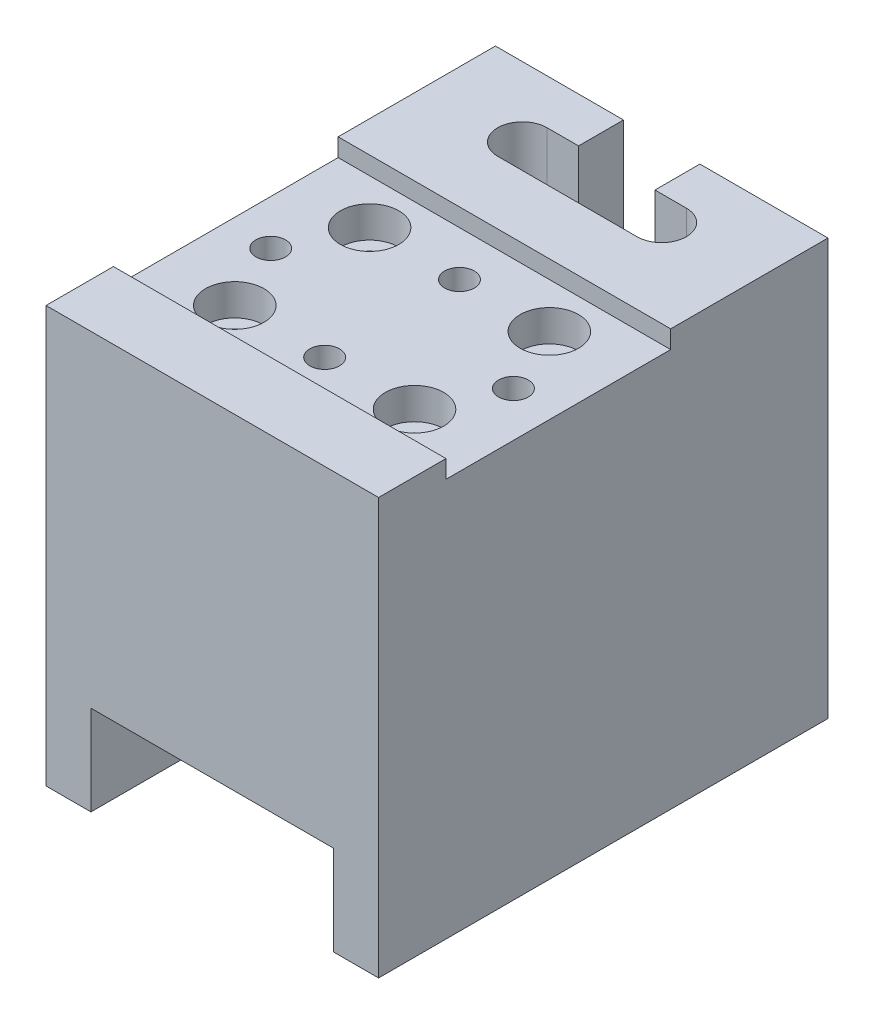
ISO-10303-21;
HEADER;
FILE_DESCRIPTION(('STEP AP214'),'2;1');
FILE_NAME('part.step','',(''),(''),'','','');
FILE_SCHEMA(('AUTOMOTIVE_DESIGN { 1 0 10303 214 1 1 1 1 }'));
ENDSEC;
DATA;
#1=APPLICATION_CONTEXT('core data for automotive mechanical design processes');
#2=APPLICATION_PROTOCOL_DEFINITION('international standard','automotive_design',2000,#1);
#3=PRODUCT_CONTEXT('',#1,'mechanical');
#4=PRODUCT('Part','Part','',(#3));
#5=PRODUCT_RELATED_PRODUCT_CATEGORY('part','',(#4));
#6=PRODUCT_DEFINITION_FORMATION('','',#4);
#7=PRODUCT_DEFINITION_CONTEXT('part definition',#1,'design');
#8=PRODUCT_DEFINITION('design','',#6,#7);
#9=PRODUCT_DEFINITION_SHAPE('','',#8);
#10=(LENGTH_UNIT() NAMED_UNIT(*) SI_UNIT(.MILLI.,.METRE.));
#11=(NAMED_UNIT(*) PLANE_ANGLE_UNIT() SI_UNIT($,.RADIAN.));
#12=(NAMED_UNIT(*) SI_UNIT($,.STERADIAN.) SOLID_ANGLE_UNIT());
#13=UNCERTAINTY_MEASURE_WITH_UNIT(LENGTH_MEASURE(1.E-05),#10,'distance_accuracy_value','');
#14=(GEOMETRIC_REPRESENTATION_CONTEXT(3) GLOBAL_UNCERTAINTY_ASSIGNED_CONTEXT((#13)) GLOBAL_UNIT_ASSIGNED_CONTEXT((#10,
#11,#12)) REPRESENTATION_CONTEXT('',''));
#15=CARTESIAN_POINT('',(0.,0.,0.));
#16=DIRECTION('',(0.,0.,1.));
#17=DIRECTION('',(1.,0.,0.));
#18=AXIS2_PLACEMENT_3D('',#15,#16,#17);
#19=CARTESIAN_POINT('',(8.49999999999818,-3.69999999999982,22.5));
#20=DIRECTION('',(0.,1.,0.));
#21=DIRECTION('',(0.,0.,1.));
#22=AXIS2_PLACEMENT_3D('',#19,#20,#21);
#23=CYLINDRICAL_SURFACE('',#22,1.75);
#24=CARTESIAN_POINT('',(8.49999999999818,10.,22.5));
#25=DIRECTION('',(0.,1.,0.));
#26=DIRECTION('',(0.,0.,1.));
#27=AXIS2_PLACEMENT_3D('',#24,#25,#26);
#28=CIRCLE('',#27,1.75);
#29=CARTESIAN_POINT('',(8.49999999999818,10.,24.25));
#30=VERTEX_POINT('',#29);
#31=EDGE_CURVE('E236',#30,#30,#28,.T.);
#32=ORIENTED_EDGE('',*,*,#31,.F.);
#33=EDGE_LOOP('',(#32));
#34=FACE_BOUND('',#33,.T.);
#35=CARTESIAN_POINT('',(8.49999999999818,40.8000000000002,22.5));
#36=DIRECTION('',(0.,1.,0.));
#37=DIRECTION('',(0.,0.,1.));
#38=AXIS2_PLACEMENT_3D('',#35,#36,#37);
#39=CIRCLE('',#38,1.75);
#40=CARTESIAN_POINT('',(8.49999999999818,40.8000000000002,24.25));
#41=VERTEX_POINT('',#40);
#42=EDGE_CURVE('E37',#41,#41,#39,.F.);
#43=ORIENTED_EDGE('',*,*,#42,.F.);
#44=EDGE_LOOP('',(#43));
#45=FACE_BOUND('',#44,.T.);
#46=ADVANCED_FACE('F33',(#34,#45),#23,.F.);
#47=CARTESIAN_POINT('',(28.4999999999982,-3.69999999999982,22.5));
#48=DIRECTION('',(0.,1.,0.));
#49=DIRECTION('',(0.,0.,1.));
#50=AXIS2_PLACEMENT_3D('',#47,#48,#49);
#51=CYLINDRICAL_SURFACE('',#50,1.75);
#52=CARTESIAN_POINT('',(28.4999999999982,10.,22.5));
#53=DIRECTION('',(0.,1.,0.));
#54=DIRECTION('',(0.,0.,1.));
#55=AXIS2_PLACEMENT_3D('',#52,#53,#54);
#56=CIRCLE('',#55,1.75);
#57=CARTESIAN_POINT('',(28.4999999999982,10.,24.25));
#58=VERTEX_POINT('',#57);
#59=EDGE_CURVE('E239',#58,#58,#56,.T.);
#60=ORIENTED_EDGE('',*,*,#59,.F.);
#61=EDGE_LOOP('',(#60));
#62=FACE_BOUND('',#61,.T.);
#63=CARTESIAN_POINT('',(28.4999999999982,40.8000000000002,22.5));
#64=DIRECTION('',(0.,1.,0.));
#65=DIRECTION('',(0.,0.,1.));
#66=AXIS2_PLACEMENT_3D('',#63,#64,#65);
#67=CIRCLE('',#66,1.75);
#68=CARTESIAN_POINT('',(28.4999999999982,40.8000000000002,24.25));
#69=VERTEX_POINT('',#68);
#70=EDGE_CURVE('E342',#69,#69,#67,.F.);
#71=ORIENTED_EDGE('',*,*,#70,.F.);
#72=EDGE_LOOP('',(#71));
#73=FACE_BOUND('',#72,.T.);
#74=ADVANCED_FACE('F458',(#62,#73),#51,.F.);
#75=CARTESIAN_POINT('',(28.4999999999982,-3.69999999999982,37.5));
#76=DIRECTION('',(0.,1.,0.));
#77=DIRECTION('',(0.,0.,1.));
#78=AXIS2_PLACEMENT_3D('',#75,#76,#77);
#79=CYLINDRICAL_SURFACE('',#78,1.75);
#80=CARTESIAN_POINT('',(28.4999999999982,10.,37.5));
#81=DIRECTION('',(0.,1.,0.));
#82=DIRECTION('',(0.,0.,1.));
#83=AXIS2_PLACEMENT_3D('',#80,#81,#82);
#84=CIRCLE('',#83,1.75);
#85=CARTESIAN_POINT('',(28.4999999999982,10.,39.25));
#86=VERTEX_POINT('',#85);
#87=EDGE_CURVE('E242',#86,#86,#84,.T.);
#88=ORIENTED_EDGE('',*,*,#87,.F.);
#89=EDGE_LOOP('',(#88));
#90=FACE_BOUND('',#89,.T.);
#91=CARTESIAN_POINT('',(28.4999999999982,40.8000000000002,37.5));
#92=DIRECTION('',(0.,1.,0.));
#93=DIRECTION('',(0.,0.,1.));
#94=AXIS2_PLACEMENT_3D('',#91,#92,#93);
#95=CIRCLE('',#94,1.75);
#96=CARTESIAN_POINT('',(28.4999999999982,40.8000000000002,39.25));
#97=VERTEX_POINT('',#96);
#98=EDGE_CURVE('E339',#97,#97,#95,.F.);
#99=ORIENTED_EDGE('',*,*,#98,.F.);
#100=EDGE_LOOP('',(#99));
#101=FACE_BOUND('',#100,.T.);
#102=ADVANCED_FACE('F464',(#90,#101),#79,.F.);
#103=CARTESIAN_POINT('',(8.49999999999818,-3.69999999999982,37.5));
#104=DIRECTION('',(0.,1.,0.));
#105=DIRECTION('',(0.,0.,1.));
#106=AXIS2_PLACEMENT_3D('',#103,#104,#105);
#107=CYLINDRICAL_SURFACE('',#106,1.75);
#108=CARTESIAN_POINT('',(8.49999999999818,10.,37.5));
#109=DIRECTION('',(0.,1.,0.));
#110=DIRECTION('',(0.,0.,1.));
#111=AXIS2_PLACEMENT_3D('',#108,#109,#110);
#112=CIRCLE('',#111,1.75);
#113=CARTESIAN_POINT('',(8.49999999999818,10.,39.25));
#114=VERTEX_POINT('',#113);
#115=EDGE_CURVE('E245',#114,#114,#112,.T.);
#116=ORIENTED_EDGE('',*,*,#115,.F.);
#117=EDGE_LOOP('',(#116));
#118=FACE_BOUND('',#117,.T.);
#119=CARTESIAN_POINT('',(8.49999999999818,40.8000000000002,37.5));
#120=DIRECTION('',(0.,1.,0.));
#121=DIRECTION('',(0.,0.,1.));
#122=AXIS2_PLACEMENT_3D('',#119,#120,#121);
#123=CIRCLE('',#122,1.75);
#124=CARTESIAN_POINT('',(8.49999999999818,40.8000000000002,39.25));
#125=VERTEX_POINT('',#124);
#126=EDGE_CURVE('E194',#125,#125,#123,.F.);
#127=ORIENTED_EDGE('',*,*,#126,.F.);
#128=EDGE_LOOP('',(#127));
#129=FACE_BOUND('',#128,.T.);
#130=ADVANCED_FACE('F474',(#118,#129),#107,.F.);
#131=CARTESIAN_POINT('',(5.00000000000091,10.,50.));
#132=DIRECTION('',(0.,1.,0.));
#133=DIRECTION('',(0.,0.,1.));
#134=AXIS2_PLACEMENT_3D('',#131,#132,#133);
#135=PLANE('',#134);
#136=ORIENTED_EDGE('',*,*,#115,.T.);
#137=EDGE_LOOP('',(#136));
#138=FACE_BOUND('',#137,.T.);
#139=ORIENTED_EDGE('',*,*,#87,.T.);
#140=EDGE_LOOP('',(#139));
#141=FACE_BOUND('',#140,.T.);
#142=ORIENTED_EDGE('',*,*,#59,.T.);
#143=EDGE_LOOP('',(#142));
#144=FACE_BOUND('',#143,.T.);
#145=ORIENTED_EDGE('',*,*,#31,.T.);
#146=EDGE_LOOP('',(#145));
#147=FACE_BOUND('',#146,.T.);
#148=DIRECTION('',(0.,0.,-1.));
#149=VECTOR('',#148,1.);
#150=CARTESIAN_POINT('',(14.25,10.,50.));
#151=LINE('',#150,#149);
#152=CARTESIAN_POINT('',(14.25,10.,5.));
#153=VERTEX_POINT('',#152);
#154=CARTESIAN_POINT('',(14.25,10.,0.));
#155=VERTEX_POINT('',#154);
#156=EDGE_CURVE('E224',#153,#155,#151,.T.);
#157=ORIENTED_EDGE('',*,*,#156,.F.);
#158=DIRECTION('',(1.,0.,0.));
#159=VECTOR('',#158,1.);
#160=CARTESIAN_POINT('',(5.00000000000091,10.,5.));
#161=LINE('',#160,#159);
#162=CARTESIAN_POINT('',(10.75,10.,5.));
#163=VERTEX_POINT('',#162);
#164=EDGE_CURVE('E234',#163,#153,#161,.T.);
#165=ORIENTED_EDGE('',*,*,#164,.F.);
#166=CARTESIAN_POINT('',(10.75,10.,7.75));
#167=DIRECTION('',(0.,1.,0.));
#168=DIRECTION('',(0.,0.,1.));
#169=AXIS2_PLACEMENT_3D('',#166,#167,#168);
#170=CIRCLE('',#169,2.75);
#171=CARTESIAN_POINT('',(10.75,10.,10.5));
#172=VERTEX_POINT('',#171);
#173=EDGE_CURVE('E232',#172,#163,#170,.F.);
#174=ORIENTED_EDGE('',*,*,#173,.F.);
#175=DIRECTION('',(-1.,0.,0.));
#176=VECTOR('',#175,1.);
#177=CARTESIAN_POINT('',(5.00000000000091,10.,10.5));
#178=LINE('',#177,#176);
#179=CARTESIAN_POINT('',(26.25,10.,10.5));
#180=VERTEX_POINT('',#179);
#181=EDGE_CURVE('E230',#180,#172,#178,.T.);
#182=ORIENTED_EDGE('',*,*,#181,.F.);
#183=CARTESIAN_POINT('',(26.25,10.,7.75));
#184=DIRECTION('',(0.,1.,0.));
#185=DIRECTION('',(0.,0.,1.));
#186=AXIS2_PLACEMENT_3D('',#183,#184,#185);
#187=CIRCLE('',#186,2.75);
#188=CARTESIAN_POINT('',(26.25,10.,5.));
#189=VERTEX_POINT('',#188);
#190=EDGE_CURVE('E228',#189,#180,#187,.F.);
#191=ORIENTED_EDGE('',*,*,#190,.F.);
#192=DIRECTION('',(1.,0.,0.));
#193=VECTOR('',#192,1.);
#194=CARTESIAN_POINT('',(5.00000000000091,10.,5.));
#195=LINE('',#194,#193);
#196=CARTESIAN_POINT('',(22.75,10.,5.));
#197=VERTEX_POINT('',#196);
#198=EDGE_CURVE('E226',#197,#189,#195,.T.);
#199=ORIENTED_EDGE('',*,*,#198,.F.);
#200=DIRECTION('',(0.,0.,1.));
#201=VECTOR('',#200,1.);
#202=CARTESIAN_POINT('',(22.75,10.,50.));
#203=LINE('',#202,#201);
#204=CARTESIAN_POINT('',(22.75,10.,0.));
#205=VERTEX_POINT('',#204);
#206=EDGE_CURVE('E174',#205,#197,#203,.T.);
#207=ORIENTED_EDGE('',*,*,#206,.F.);
#208=DIRECTION('',(1.,0.,0.));
#209=VECTOR('',#208,1.);
#210=CARTESIAN_POINT('',(5.00000000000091,10.,0.));
#211=LINE('',#210,#209);
#212=CARTESIAN_POINT('',(32.,10.,0.));
#213=VERTEX_POINT('',#212);
#214=EDGE_CURVE('E289',#205,#213,#211,.T.);
#215=ORIENTED_EDGE('',*,*,#214,.T.);
#216=DIRECTION('',(0.,0.,-1.));
#217=VECTOR('',#216,1.);
#218=CARTESIAN_POINT('',(32.,10.,50.));
#219=LINE('',#218,#217);
#220=CARTESIAN_POINT('',(32.,10.,50.));
#221=VERTEX_POINT('',#220);
#222=EDGE_CURVE('E324',#221,#213,#219,.T.);
#223=ORIENTED_EDGE('',*,*,#222,.F.);
#224=DIRECTION('',(1.,0.,0.));
#225=VECTOR('',#224,1.);
#226=CARTESIAN_POINT('',(5.00000000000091,10.,50.));
#227=LINE('',#226,#225);
#228=CARTESIAN_POINT('',(5.00000000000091,10.,50.));
#229=VERTEX_POINT('',#228);
#230=EDGE_CURVE('E271',#229,#221,#227,.T.);
#231=ORIENTED_EDGE('',*,*,#230,.F.);
#232=DIRECTION('',(0.,0.,-1.));
#233=VECTOR('',#232,1.);
#234=CARTESIAN_POINT('',(5.00000000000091,10.,50.));
#235=LINE('',#234,#233);
#236=CARTESIAN_POINT('',(5.00000000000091,10.,0.));
#237=VERTEX_POINT('',#236);
#238=EDGE_CURVE('E327',#229,#237,#235,.T.);
#239=ORIENTED_EDGE('',*,*,#238,.T.);
#240=EDGE_CURVE('E290',#237,#155,#211,.T.);
#241=ORIENTED_EDGE('',*,*,#240,.T.);
#242=EDGE_LOOP('',(#157,#165,#174,#182,#191,#199,#207,#215,#223,#231,#239,#241));
#243=FACE_BOUND('',#242,.T.);
#244=ADVANCED_FACE('F425',(#138,#141,#144,#147,#243),#135,.F.);
#245=CARTESIAN_POINT('',(0.,46.3000000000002,50.));
#246=DIRECTION('',(0.,-1.,0.));
#247=DIRECTION('',(0.,0.,-1.));
#248=AXIS2_PLACEMENT_3D('',#245,#246,#247);
#249=PLANE('',#248);
#250=DIRECTION('',(0.,0.,-1.));
#251=VECTOR('',#250,1.);
#252=CARTESIAN_POINT('',(14.25,46.3000000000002,5.));
#253=LINE('',#252,#251);
#254=CARTESIAN_POINT('',(14.25,46.3000000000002,5.));
#255=VERTEX_POINT('',#254);
#256=CARTESIAN_POINT('',(14.25,46.3000000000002,0.));
#257=VERTEX_POINT('',#256);
#258=EDGE_CURVE('E178',#255,#257,#253,.T.);
#259=ORIENTED_EDGE('',*,*,#258,.T.);
#260=DIRECTION('',(-1.,0.,0.));
#261=VECTOR('',#260,1.);
#262=CARTESIAN_POINT('',(0.,46.3000000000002,0.));
#263=LINE('',#262,#261);
#264=CARTESIAN_POINT('',(0.,46.3000000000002,0.));
#265=VERTEX_POINT('',#264);
#266=EDGE_CURVE('E300',#257,#265,#263,.T.);
#267=ORIENTED_EDGE('',*,*,#266,.T.);
#268=DIRECTION('',(0.,0.,-1.));
#269=VECTOR('',#268,1.);
#270=CARTESIAN_POINT('',(0.,46.3000000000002,50.));
#271=LINE('',#270,#269);
#272=CARTESIAN_POINT('',(0.,46.3000000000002,17.5));
#273=VERTEX_POINT('',#272);
#274=EDGE_CURVE('E310',#273,#265,#271,.T.);
#275=ORIENTED_EDGE('',*,*,#274,.F.);
#276=DIRECTION('',(-1.,0.,0.));
#277=VECTOR('',#276,1.);
#278=CARTESIAN_POINT('',(173.926921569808,46.3000000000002,17.5));
#279=LINE('',#278,#277);
#280=CARTESIAN_POINT('',(37.,46.3000000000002,17.5));
#281=VERTEX_POINT('',#280);
#282=EDGE_CURVE('E58',#281,#273,#279,.T.);
#283=ORIENTED_EDGE('',*,*,#282,.F.);
#284=DIRECTION('',(0.,0.,-1.));
#285=VECTOR('',#284,1.);
#286=CARTESIAN_POINT('',(37.,46.3000000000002,50.));
#287=LINE('',#286,#285);
#288=CARTESIAN_POINT('',(37.,46.3000000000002,0.));
#289=VERTEX_POINT('',#288);
#290=EDGE_CURVE('E314',#281,#289,#287,.T.);
#291=ORIENTED_EDGE('',*,*,#290,.T.);
#292=CARTESIAN_POINT('',(22.75,46.3000000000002,0.));
#293=VERTEX_POINT('',#292);
#294=EDGE_CURVE('E193',#289,#293,#263,.T.);
#295=ORIENTED_EDGE('',*,*,#294,.T.);
#296=DIRECTION('',(0.,0.,1.));
#297=VECTOR('',#296,1.);
#298=CARTESIAN_POINT('',(22.75,46.3000000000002,5.));
#299=LINE('',#298,#297);
#300=CARTESIAN_POINT('',(22.75,46.3000000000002,5.));
#301=VERTEX_POINT('',#300);
#302=EDGE_CURVE('E50',#293,#301,#299,.T.);
#303=ORIENTED_EDGE('',*,*,#302,.T.);
#304=DIRECTION('',(1.,0.,0.));
#305=VECTOR('',#304,1.);
#306=CARTESIAN_POINT('',(22.75,46.3000000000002,5.));
#307=LINE('',#306,#305);
#308=CARTESIAN_POINT('',(26.25,46.3000000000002,5.));
#309=VERTEX_POINT('',#308);
#310=EDGE_CURVE('E181',#301,#309,#307,.T.);
#311=ORIENTED_EDGE('',*,*,#310,.T.);
#312=CARTESIAN_POINT('',(26.25,46.3000000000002,7.75));
#313=DIRECTION('',(0.,-1.,0.));
#314=DIRECTION('',(0.,0.,1.));
#315=AXIS2_PLACEMENT_3D('',#312,#313,#314);
#316=CIRCLE('',#315,2.75);
#317=CARTESIAN_POINT('',(26.25,46.3000000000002,10.5));
#318=VERTEX_POINT('',#317);
#319=EDGE_CURVE('E187',#309,#318,#316,.T.);
#320=ORIENTED_EDGE('',*,*,#319,.T.);
#321=DIRECTION('',(-1.,0.,0.));
#322=VECTOR('',#321,1.);
#323=CARTESIAN_POINT('',(10.75,46.3000000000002,10.5));
#324=LINE('',#323,#322);
#325=CARTESIAN_POINT('',(10.75,46.3000000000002,10.5));
#326=VERTEX_POINT('',#325);
#327=EDGE_CURVE('E204',#318,#326,#324,.T.);
#328=ORIENTED_EDGE('',*,*,#327,.T.);
#329=CARTESIAN_POINT('',(10.75,46.3000000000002,7.75));
#330=DIRECTION('',(0.,-1.,0.));
#331=DIRECTION('',(0.,0.,1.));
#332=AXIS2_PLACEMENT_3D('',#329,#330,#331);
#333=CIRCLE('',#332,2.75);
#334=CARTESIAN_POINT('',(10.75,46.3000000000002,5.));
#335=VERTEX_POINT('',#334);
#336=EDGE_CURVE('E207',#326,#335,#333,.T.);
#337=ORIENTED_EDGE('',*,*,#336,.T.);
#338=DIRECTION('',(1.,0.,0.));
#339=VECTOR('',#338,1.);
#340=CARTESIAN_POINT('',(10.75,46.3000000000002,5.));
#341=LINE('',#340,#339);
#342=EDGE_CURVE('E210',#335,#255,#341,.T.);
#343=ORIENTED_EDGE('',*,*,#342,.T.);
#344=EDGE_LOOP('',(#259,#267,#275,#283,#291,#295,#303,#311,#320,#328,#337,#343));
#345=FACE_BOUND('',#344,.T.);
#346=ADVANCED_FACE('F191',(#345),#249,.F.);
#347=CARTESIAN_POINT('',(5.00000000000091,10.,0.));
#348=DIRECTION('',(0.,0.,-1.));
#349=DIRECTION('',(-1.,0.,0.));
#350=AXIS2_PLACEMENT_3D('',#347,#348,#349);
#351=PLANE('',#350);
#352=ORIENTED_EDGE('',*,*,#266,.F.);
#353=DIRECTION('',(0.,-1.,0.));
#354=VECTOR('',#353,1.);
#355=CARTESIAN_POINT('',(14.25,10.,0.));
#356=LINE('',#355,#354);
#357=EDGE_CURVE('E12',#257,#155,#356,.T.);
#358=ORIENTED_EDGE('',*,*,#357,.T.);
#359=ORIENTED_EDGE('',*,*,#240,.F.);
#360=DIRECTION('',(0.,1.,0.));
#361=VECTOR('',#360,1.);
#362=CARTESIAN_POINT('',(5.,0.,0.));
#363=LINE('',#362,#361);
#364=CARTESIAN_POINT('',(5.,0.,0.));
#365=VERTEX_POINT('',#364);
#366=EDGE_CURVE('E267',#365,#237,#363,.T.);
#367=ORIENTED_EDGE('',*,*,#366,.F.);
#368=DIRECTION('',(1.,0.,0.));
#369=VECTOR('',#368,1.);
#370=CARTESIAN_POINT('',(0.,0.,0.));
#371=LINE('',#370,#369);
#372=CARTESIAN_POINT('',(0.,0.,0.));
#373=VERTEX_POINT('',#372);
#374=EDGE_CURVE('E272',#373,#365,#371,.T.);
#375=ORIENTED_EDGE('',*,*,#374,.F.);
#376=DIRECTION('',(0.,-1.,0.));
#377=VECTOR('',#376,1.);
#378=CARTESIAN_POINT('',(0.,0.,0.));
#379=LINE('',#378,#377);
#380=EDGE_CURVE('E302',#265,#373,#379,.T.);
#381=ORIENTED_EDGE('',*,*,#380,.F.);
#382=EDGE_LOOP('',(#352,#358,#359,#367,#375,#381));
#383=FACE_BOUND('',#382,.T.);
#384=ADVANCED_FACE('F392',(#383),#351,.T.);
#385=ORIENTED_EDGE('',*,*,#214,.F.);
#386=DIRECTION('',(0.,1.,0.));
#387=VECTOR('',#386,1.);
#388=CARTESIAN_POINT('',(22.75,10.,0.));
#389=LINE('',#388,#387);
#390=EDGE_CURVE('E42',#205,#293,#389,.T.);
#391=ORIENTED_EDGE('',*,*,#390,.T.);
#392=ORIENTED_EDGE('',*,*,#294,.F.);
#393=DIRECTION('',(0.,1.,0.));
#394=VECTOR('',#393,1.);
#395=CARTESIAN_POINT('',(37.,0.,0.));
#396=LINE('',#395,#394);
#397=CARTESIAN_POINT('',(37.,0.,0.));
#398=VERTEX_POINT('',#397);
#399=EDGE_CURVE('E297',#398,#289,#396,.T.);
#400=ORIENTED_EDGE('',*,*,#399,.F.);
#401=DIRECTION('',(1.,0.,0.));
#402=VECTOR('',#401,1.);
#403=CARTESIAN_POINT('',(32.,0.,0.));
#404=LINE('',#403,#402);
#405=CARTESIAN_POINT('',(32.,0.,0.));
#406=VERTEX_POINT('',#405);
#407=EDGE_CURVE('E295',#406,#398,#404,.T.);
#408=ORIENTED_EDGE('',*,*,#407,.F.);
#409=DIRECTION('',(0.,-1.,0.));
#410=VECTOR('',#409,1.);
#411=CARTESIAN_POINT('',(32.,0.,0.));
#412=LINE('',#411,#410);
#413=EDGE_CURVE('E293',#213,#406,#412,.T.);
#414=ORIENTED_EDGE('',*,*,#413,.F.);
#415=EDGE_LOOP('',(#385,#391,#392,#400,#408,#414));
#416=FACE_BOUND('',#415,.T.);
#417=ADVANCED_FACE('F422',(#416),#351,.T.);
#418=CARTESIAN_POINT('',(37.,46.3000000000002,50.));
#419=VERTEX_POINT('',#418);
#420=CARTESIAN_POINT('',(37.,46.3000000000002,42.5));
#421=VERTEX_POINT('',#420);
#422=EDGE_CURVE('E315',#419,#421,#287,.T.);
#423=ORIENTED_EDGE('',*,*,#422,.T.);
#424=DIRECTION('',(-1.,0.,0.));
#425=VECTOR('',#424,1.);
#426=CARTESIAN_POINT('',(173.926921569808,46.3000000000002,42.5));
#427=LINE('',#426,#425);
#428=CARTESIAN_POINT('',(0.,46.3000000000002,42.5));
#429=VERTEX_POINT('',#428);
#430=EDGE_CURVE('E255',#421,#429,#427,.T.);
#431=ORIENTED_EDGE('',*,*,#430,.T.);
#432=CARTESIAN_POINT('',(0.,46.3000000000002,50.));
#433=VERTEX_POINT('',#432);
#434=EDGE_CURVE('E311',#433,#429,#271,.T.);
#435=ORIENTED_EDGE('',*,*,#434,.F.);
#436=DIRECTION('',(-1.,0.,0.));
#437=VECTOR('',#436,1.);
#438=CARTESIAN_POINT('',(0.,46.3000000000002,50.));
#439=LINE('',#438,#437);
#440=EDGE_CURVE('E280',#419,#433,#439,.T.);
#441=ORIENTED_EDGE('',*,*,#440,.F.);
#442=EDGE_LOOP('',(#423,#431,#435,#441));
#443=FACE_BOUND('',#442,.T.);
#444=ADVANCED_FACE('F408',(#443),#249,.F.);
#445=CARTESIAN_POINT('',(5.,0.,50.));
#446=DIRECTION('',(-1.,0.,0.));
#447=DIRECTION('',(0.,-1.,0.));
#448=AXIS2_PLACEMENT_3D('',#445,#446,#447);
#449=PLANE('',#448);
#450=ORIENTED_EDGE('',*,*,#366,.T.);
#451=ORIENTED_EDGE('',*,*,#238,.F.);
#452=DIRECTION('',(0.,1.,0.));
#453=VECTOR('',#452,1.);
#454=CARTESIAN_POINT('',(5.,0.,50.));
#455=LINE('',#454,#453);
#456=CARTESIAN_POINT('',(5.,0.,50.));
#457=VERTEX_POINT('',#456);
#458=EDGE_CURVE('E268',#457,#229,#455,.T.);
#459=ORIENTED_EDGE('',*,*,#458,.F.);
#460=DIRECTION('',(0.,0.,-1.));
#461=VECTOR('',#460,1.);
#462=CARTESIAN_POINT('',(5.,0.,50.));
#463=LINE('',#462,#461);
#464=EDGE_CURVE('E286',#457,#365,#463,.T.);
#465=ORIENTED_EDGE('',*,*,#464,.T.);
#466=EDGE_LOOP('',(#450,#451,#459,#465));
#467=FACE_BOUND('',#466,.T.);
#468=ADVANCED_FACE('F35',(#467),#449,.F.);
#469=CARTESIAN_POINT('',(32.,0.,50.));
#470=DIRECTION('',(1.,0.,0.));
#471=DIRECTION('',(0.,0.,-1.));
#472=AXIS2_PLACEMENT_3D('',#469,#470,#471);
#473=PLANE('',#472);
#474=ORIENTED_EDGE('',*,*,#413,.T.);
#475=DIRECTION('',(0.,0.,-1.));
#476=VECTOR('',#475,1.);
#477=CARTESIAN_POINT('',(32.,0.,50.));
#478=LINE('',#477,#476);
#479=CARTESIAN_POINT('',(32.,0.,50.));
#480=VERTEX_POINT('',#479);
#481=EDGE_CURVE('E321',#480,#406,#478,.T.);
#482=ORIENTED_EDGE('',*,*,#481,.F.);
#483=DIRECTION('',(0.,-1.,0.));
#484=VECTOR('',#483,1.);
#485=CARTESIAN_POINT('',(32.,0.,50.));
#486=LINE('',#485,#484);
#487=EDGE_CURVE('E274',#221,#480,#486,.T.);
#488=ORIENTED_EDGE('',*,*,#487,.F.);
#489=ORIENTED_EDGE('',*,*,#222,.T.);
#490=EDGE_LOOP('',(#474,#482,#488,#489));
#491=FACE_BOUND('',#490,.T.);
#492=ADVANCED_FACE('F449',(#491),#473,.F.);
#493=CARTESIAN_POINT('',(32.,0.,50.));
#494=DIRECTION('',(0.,1.,0.));
#495=DIRECTION('',(0.,0.,1.));
#496=AXIS2_PLACEMENT_3D('',#493,#494,#495);
#497=PLANE('',#496);
#498=ORIENTED_EDGE('',*,*,#407,.T.);
#499=DIRECTION('',(0.,0.,-1.));
#500=VECTOR('',#499,1.);
#501=CARTESIAN_POINT('',(37.,0.,50.));
#502=LINE('',#501,#500);
#503=CARTESIAN_POINT('',(37.,0.,50.));
#504=VERTEX_POINT('',#503);
#505=EDGE_CURVE('E318',#504,#398,#502,.T.);
#506=ORIENTED_EDGE('',*,*,#505,.F.);
#507=DIRECTION('',(1.,0.,0.));
#508=VECTOR('',#507,1.);
#509=CARTESIAN_POINT('',(32.,0.,50.));
#510=LINE('',#509,#508);
#511=EDGE_CURVE('E276',#480,#504,#510,.T.);
#512=ORIENTED_EDGE('',*,*,#511,.F.);
#513=ORIENTED_EDGE('',*,*,#481,.T.);
#514=EDGE_LOOP('',(#498,#506,#512,#513));
#515=FACE_BOUND('',#514,.T.);
#516=ADVANCED_FACE('F417',(#515),#497,.F.);
#517=CARTESIAN_POINT('',(37.,0.,50.));
#518=DIRECTION('',(-1.,0.,0.));
#519=DIRECTION('',(0.,0.,1.));
#520=AXIS2_PLACEMENT_3D('',#517,#518,#519);
#521=PLANE('',#520);
#522=DIRECTION('',(0.,0.,1.));
#523=VECTOR('',#522,1.);
#524=CARTESIAN_POINT('',(37.,44.3000000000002,50.));
#525=LINE('',#524,#523);
#526=CARTESIAN_POINT('',(37.,44.3000000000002,17.5));
#527=VERTEX_POINT('',#526);
#528=CARTESIAN_POINT('',(37.,44.3000000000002,42.5));
#529=VERTEX_POINT('',#528);
#530=EDGE_CURVE('E261',#527,#529,#525,.T.);
#531=ORIENTED_EDGE('',*,*,#530,.T.);
#532=DIRECTION('',(0.,1.,0.));
#533=VECTOR('',#532,1.);
#534=CARTESIAN_POINT('',(37.,0.,42.5));
#535=LINE('',#534,#533);
#536=EDGE_CURVE('E264',#529,#421,#535,.T.);
#537=ORIENTED_EDGE('',*,*,#536,.T.);
#538=ORIENTED_EDGE('',*,*,#422,.F.);
#539=DIRECTION('',(0.,1.,0.));
#540=VECTOR('',#539,1.);
#541=CARTESIAN_POINT('',(37.,0.,50.));
#542=LINE('',#541,#540);
#543=EDGE_CURVE('E278',#504,#419,#542,.T.);
#544=ORIENTED_EDGE('',*,*,#543,.F.);
#545=ORIENTED_EDGE('',*,*,#505,.T.);
#546=ORIENTED_EDGE('',*,*,#399,.T.);
#547=ORIENTED_EDGE('',*,*,#290,.F.);
#548=DIRECTION('',(0.,-1.,0.));
#549=VECTOR('',#548,1.);
#550=CARTESIAN_POINT('',(37.,0.,17.5));
#551=LINE('',#550,#549);
#552=EDGE_CURVE('E258',#281,#527,#551,.T.);
#553=ORIENTED_EDGE('',*,*,#552,.T.);
#554=EDGE_LOOP('',(#531,#537,#538,#544,#545,#546,#547,#553));
#555=FACE_BOUND('',#554,.T.);
#556=ADVANCED_FACE('F381',(#555),#521,.F.);
#557=CARTESIAN_POINT('',(0.,0.,50.));
#558=DIRECTION('',(1.,0.,0.));
#559=DIRECTION('',(0.,0.,-1.));
#560=AXIS2_PLACEMENT_3D('',#557,#558,#559);
#561=PLANE('',#560);
#562=ORIENTED_EDGE('',*,*,#434,.T.);
#563=DIRECTION('',(0.,-1.,0.));
#564=VECTOR('',#563,1.);
#565=CARTESIAN_POINT('',(0.,0.,42.5));
#566=LINE('',#565,#564);
#567=CARTESIAN_POINT('',(0.,44.3000000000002,42.5));
#568=VERTEX_POINT('',#567);
#569=EDGE_CURVE('E335',#429,#568,#566,.T.);
#570=ORIENTED_EDGE('',*,*,#569,.T.);
#571=DIRECTION('',(0.,0.,-1.));
#572=VECTOR('',#571,1.);
#573=CARTESIAN_POINT('',(0.,44.3000000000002,50.));
#574=LINE('',#573,#572);
#575=CARTESIAN_POINT('',(0.,44.3000000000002,17.5));
#576=VERTEX_POINT('',#575);
#577=EDGE_CURVE('E332',#568,#576,#574,.T.);
#578=ORIENTED_EDGE('',*,*,#577,.T.);
#579=DIRECTION('',(0.,1.,0.));
#580=VECTOR('',#579,1.);
#581=CARTESIAN_POINT('',(0.,0.,17.5));
#582=LINE('',#581,#580);
#583=EDGE_CURVE('E330',#576,#273,#582,.T.);
#584=ORIENTED_EDGE('',*,*,#583,.T.);
#585=ORIENTED_EDGE('',*,*,#274,.T.);
#586=ORIENTED_EDGE('',*,*,#380,.T.);
#587=DIRECTION('',(0.,0.,-1.));
#588=VECTOR('',#587,1.);
#589=CARTESIAN_POINT('',(0.,0.,50.));
#590=LINE('',#589,#588);
#591=CARTESIAN_POINT('',(0.,0.,50.));
#592=VERTEX_POINT('',#591);
#593=EDGE_CURVE('E307',#592,#373,#590,.T.);
#594=ORIENTED_EDGE('',*,*,#593,.F.);
#595=DIRECTION('',(0.,-1.,0.));
#596=VECTOR('',#595,1.);
#597=CARTESIAN_POINT('',(0.,0.,50.));
#598=LINE('',#597,#596);
#599=EDGE_CURVE('E282',#433,#592,#598,.T.);
#600=ORIENTED_EDGE('',*,*,#599,.F.);
#601=EDGE_LOOP('',(#562,#570,#578,#584,#585,#586,#594,#600));
#602=FACE_BOUND('',#601,.T.);
#603=ADVANCED_FACE('F388',(#602),#561,.F.);
#604=CARTESIAN_POINT('',(0.,0.,50.));
#605=DIRECTION('',(0.,1.,0.));
#606=DIRECTION('',(0.,0.,1.));
#607=AXIS2_PLACEMENT_3D('',#604,#605,#606);
#608=PLANE('',#607);
#609=ORIENTED_EDGE('',*,*,#374,.T.);
#610=ORIENTED_EDGE('',*,*,#464,.F.);
#611=DIRECTION('',(1.,0.,0.));
#612=VECTOR('',#611,1.);
#613=CARTESIAN_POINT('',(0.,0.,50.));
#614=LINE('',#613,#612);
#615=EDGE_CURVE('E284',#592,#457,#614,.T.);
#616=ORIENTED_EDGE('',*,*,#615,.F.);
#617=ORIENTED_EDGE('',*,*,#593,.T.);
#618=EDGE_LOOP('',(#609,#610,#616,#617));
#619=FACE_BOUND('',#618,.T.);
#620=ADVANCED_FACE('F396',(#619),#608,.F.);
#621=CARTESIAN_POINT('',(5.00000000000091,10.,50.));
#622=DIRECTION('',(0.,0.,-1.));
#623=DIRECTION('',(-1.,0.,0.));
#624=AXIS2_PLACEMENT_3D('',#621,#622,#623);
#625=PLANE('',#624);
#626=ORIENTED_EDGE('',*,*,#458,.T.);
#627=ORIENTED_EDGE('',*,*,#230,.T.);
#628=ORIENTED_EDGE('',*,*,#487,.T.);
#629=ORIENTED_EDGE('',*,*,#511,.T.);
#630=ORIENTED_EDGE('',*,*,#543,.T.);
#631=ORIENTED_EDGE('',*,*,#440,.T.);
#632=ORIENTED_EDGE('',*,*,#599,.T.);
#633=ORIENTED_EDGE('',*,*,#615,.T.);
#634=EDGE_LOOP('',(#626,#627,#628,#629,#630,#631,#632,#633));
#635=FACE_BOUND('',#634,.T.);
#636=ADVANCED_FACE('F402',(#635),#625,.F.);
#637=CARTESIAN_POINT('',(173.926921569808,46.3000000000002,42.5));
#638=DIRECTION('',(0.,0.,1.));
#639=DIRECTION('',(1.,0.,0.));
#640=AXIS2_PLACEMENT_3D('',#637,#638,#639);
#641=PLANE('',#640);
#642=ORIENTED_EDGE('',*,*,#536,.F.);
#643=DIRECTION('',(-1.,0.,0.));
#644=VECTOR('',#643,1.);
#645=CARTESIAN_POINT('',(173.926921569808,44.3000000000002,42.5));
#646=LINE('',#645,#644);
#647=EDGE_CURVE('E252',#529,#568,#646,.T.);
#648=ORIENTED_EDGE('',*,*,#647,.T.);
#649=ORIENTED_EDGE('',*,*,#569,.F.);
#650=ORIENTED_EDGE('',*,*,#430,.F.);
#651=EDGE_LOOP('',(#642,#648,#649,#650));
#652=FACE_BOUND('',#651,.T.);
#653=ADVANCED_FACE('F374',(#652),#641,.F.);
#654=CARTESIAN_POINT('',(173.926921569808,44.3000000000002,42.5));
#655=DIRECTION('',(0.,-1.,0.));
#656=DIRECTION('',(0.,0.,-1.));
#657=AXIS2_PLACEMENT_3D('',#654,#655,#656);
#658=PLANE('',#657);
#659=CARTESIAN_POINT('',(5.,44.3000000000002,30.));
#660=DIRECTION('',(0.,1.,0.));
#661=DIRECTION('',(0.,0.,1.));
#662=AXIS2_PLACEMENT_3D('',#659,#660,#661);
#663=CIRCLE('',#662,1.65);
#664=CARTESIAN_POINT('',(5.,44.3000000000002,31.65));
#665=VERTEX_POINT('',#664);
#666=EDGE_CURVE('E836',#665,#665,#663,.T.);
#667=ORIENTED_EDGE('',*,*,#666,.F.);
#668=EDGE_LOOP('',(#667));
#669=FACE_BOUND('',#668,.T.);
#670=CARTESIAN_POINT('',(18.5,44.3000000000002,37.5));
#671=DIRECTION('',(0.,1.,0.));
#672=DIRECTION('',(0.,0.,1.));
#673=AXIS2_PLACEMENT_3D('',#670,#671,#672);
#674=CIRCLE('',#673,1.65);
#675=CARTESIAN_POINT('',(18.5,44.3000000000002,39.15));
#676=VERTEX_POINT('',#675);
#677=EDGE_CURVE('E835',#676,#676,#674,.T.);
#678=ORIENTED_EDGE('',*,*,#677,.F.);
#679=EDGE_LOOP('',(#678));
#680=FACE_BOUND('',#679,.T.);
#681=CARTESIAN_POINT('',(32.,44.3000000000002,30.));
#682=DIRECTION('',(0.,1.,0.));
#683=DIRECTION('',(0.,0.,1.));
#684=AXIS2_PLACEMENT_3D('',#681,#682,#683);
#685=CIRCLE('',#684,1.65);
#686=CARTESIAN_POINT('',(32.,44.3000000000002,31.65));
#687=VERTEX_POINT('',#686);
#688=EDGE_CURVE('E845',#687,#687,#685,.T.);
#689=ORIENTED_EDGE('',*,*,#688,.F.);
#690=EDGE_LOOP('',(#689));
#691=FACE_BOUND('',#690,.T.);
#692=CARTESIAN_POINT('',(18.5,44.3000000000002,22.5));
#693=DIRECTION('',(0.,1.,0.));
#694=DIRECTION('',(0.,0.,1.));
#695=AXIS2_PLACEMENT_3D('',#692,#693,#694);
#696=CIRCLE('',#695,1.65);
#697=CARTESIAN_POINT('',(18.5,44.3000000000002,24.15));
#698=VERTEX_POINT('',#697);
#699=EDGE_CURVE('E850',#698,#698,#696,.T.);
#700=ORIENTED_EDGE('',*,*,#699,.F.);
#701=EDGE_LOOP('',(#700));
#702=FACE_BOUND('',#701,.T.);
#703=CARTESIAN_POINT('',(8.49999999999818,44.3000000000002,22.5));
#704=DIRECTION('',(0.,1.,0.));
#705=DIRECTION('',(0.,0.,1.));
#706=AXIS2_PLACEMENT_3D('',#703,#704,#705);
#707=CIRCLE('',#706,3.25);
#708=CARTESIAN_POINT('',(8.49999999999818,44.3000000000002,25.75));
#709=VERTEX_POINT('',#708);
#710=EDGE_CURVE('E358',#709,#709,#707,.T.);
#711=ORIENTED_EDGE('',*,*,#710,.F.);
#712=EDGE_LOOP('',(#711));
#713=FACE_BOUND('',#712,.T.);
#714=CARTESIAN_POINT('',(28.4999999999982,44.3000000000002,22.5));
#715=DIRECTION('',(0.,1.,0.));
#716=DIRECTION('',(0.,0.,1.));
#717=AXIS2_PLACEMENT_3D('',#714,#715,#716);
#718=CIRCLE('',#717,3.25);
#719=CARTESIAN_POINT('',(28.4999999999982,44.3000000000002,25.75));
#720=VERTEX_POINT('',#719);
#721=EDGE_CURVE('E351',#720,#720,#718,.T.);
#722=ORIENTED_EDGE('',*,*,#721,.F.);
#723=EDGE_LOOP('',(#722));
#724=FACE_BOUND('',#723,.T.);
#725=CARTESIAN_POINT('',(28.4999999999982,44.3000000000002,37.5));
#726=DIRECTION('',(0.,1.,0.));
#727=DIRECTION('',(0.,0.,1.));
#728=AXIS2_PLACEMENT_3D('',#725,#726,#727);
#729=CIRCLE('',#728,3.25);
#730=CARTESIAN_POINT('',(28.4999999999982,44.3000000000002,40.75));
#731=VERTEX_POINT('',#730);
#732=EDGE_CURVE('E344',#731,#731,#729,.T.);
#733=ORIENTED_EDGE('',*,*,#732,.F.);
#734=EDGE_LOOP('',(#733));
#735=FACE_BOUND('',#734,.T.);
#736=CARTESIAN_POINT('',(8.49999999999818,44.3000000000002,37.5));
#737=DIRECTION('',(0.,1.,0.));
#738=DIRECTION('',(0.,0.,1.));
#739=AXIS2_PLACEMENT_3D('',#736,#737,#738);
#740=CIRCLE('',#739,3.25);
#741=CARTESIAN_POINT('',(8.49999999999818,44.3000000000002,40.75));
#742=VERTEX_POINT('',#741);
#743=EDGE_CURVE('E200',#742,#742,#740,.T.);
#744=ORIENTED_EDGE('',*,*,#743,.F.);
#745=EDGE_LOOP('',(#744));
#746=FACE_BOUND('',#745,.T.);
#747=ORIENTED_EDGE('',*,*,#530,.F.);
#748=DIRECTION('',(-1.,0.,0.));
#749=VECTOR('',#748,1.);
#750=CARTESIAN_POINT('',(173.926921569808,44.3000000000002,17.5));
#751=LINE('',#750,#749);
#752=EDGE_CURVE('E249',#527,#576,#751,.T.);
#753=ORIENTED_EDGE('',*,*,#752,.T.);
#754=ORIENTED_EDGE('',*,*,#577,.F.);
#755=ORIENTED_EDGE('',*,*,#647,.F.);
#756=EDGE_LOOP('',(#747,#753,#754,#755));
#757=FACE_BOUND('',#756,.T.);
#758=ADVANCED_FACE('F370',(#669,#680,#691,#702,#713,#724,#735,#746,#757),#658,.F.);
#759=CARTESIAN_POINT('',(173.926921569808,46.3000000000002,17.5));
#760=DIRECTION('',(0.,0.,-1.));
#761=DIRECTION('',(-1.,0.,0.));
#762=AXIS2_PLACEMENT_3D('',#759,#760,#761);
#763=PLANE('',#762);
#764=ORIENTED_EDGE('',*,*,#552,.F.);
#765=ORIENTED_EDGE('',*,*,#282,.T.);
#766=ORIENTED_EDGE('',*,*,#583,.F.);
#767=ORIENTED_EDGE('',*,*,#752,.F.);
#768=EDGE_LOOP('',(#764,#765,#766,#767));
#769=FACE_BOUND('',#768,.T.);
#770=ADVANCED_FACE('F373',(#769),#763,.F.);
#771=CARTESIAN_POINT('',(10.75,-3.69999999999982,5.));
#772=DIRECTION('',(0.,0.,1.));
#773=DIRECTION('',(1.,0.,0.));
#774=AXIS2_PLACEMENT_3D('',#771,#772,#773);
#775=PLANE('',#774);
#776=ORIENTED_EDGE('',*,*,#164,.T.);
#777=DIRECTION('',(0.,1.,0.));
#778=VECTOR('',#777,1.);
#779=CARTESIAN_POINT('',(14.25,-3.69999999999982,5.));
#780=LINE('',#779,#778);
#781=EDGE_CURVE('E214',#153,#255,#780,.T.);
#782=ORIENTED_EDGE('',*,*,#781,.T.);
#783=ORIENTED_EDGE('',*,*,#342,.F.);
#784=DIRECTION('',(0.,1.,0.));
#785=VECTOR('',#784,1.);
#786=CARTESIAN_POINT('',(10.75,-3.69999999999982,5.));
#787=LINE('',#786,#785);
#788=EDGE_CURVE('E216',#163,#335,#787,.T.);
#789=ORIENTED_EDGE('',*,*,#788,.F.);
#790=EDGE_LOOP('',(#776,#782,#783,#789));
#791=FACE_BOUND('',#790,.T.);
#792=ADVANCED_FACE('F443',(#791),#775,.T.);
#793=CARTESIAN_POINT('',(10.75,-3.69999999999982,7.75));
#794=DIRECTION('',(0.,1.,0.));
#795=DIRECTION('',(0.,0.,1.));
#796=AXIS2_PLACEMENT_3D('',#793,#794,#795);
#797=CYLINDRICAL_SURFACE('',#796,2.75);
#798=ORIENTED_EDGE('',*,*,#173,.T.);
#799=ORIENTED_EDGE('',*,*,#788,.T.);
#800=ORIENTED_EDGE('',*,*,#336,.F.);
#801=DIRECTION('',(0.,1.,0.));
#802=VECTOR('',#801,1.);
#803=CARTESIAN_POINT('',(10.75,-3.69999999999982,10.5));
#804=LINE('',#803,#802);
#805=EDGE_CURVE('E218',#172,#326,#804,.T.);
#806=ORIENTED_EDGE('',*,*,#805,.F.);
#807=EDGE_LOOP('',(#798,#799,#800,#806));
#808=FACE_BOUND('',#807,.T.);
#809=ADVANCED_FACE('F438',(#808),#797,.F.);
#810=CARTESIAN_POINT('',(10.75,-3.69999999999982,10.5));
#811=DIRECTION('',(0.,0.,-1.));
#812=DIRECTION('',(-1.,0.,0.));
#813=AXIS2_PLACEMENT_3D('',#810,#811,#812);
#814=PLANE('',#813);
#815=ORIENTED_EDGE('',*,*,#181,.T.);
#816=ORIENTED_EDGE('',*,*,#805,.T.);
#817=ORIENTED_EDGE('',*,*,#327,.F.);
#818=DIRECTION('',(0.,1.,0.));
#819=VECTOR('',#818,1.);
#820=CARTESIAN_POINT('',(26.25,-3.69999999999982,10.5));
#821=LINE('',#820,#819);
#822=EDGE_CURVE('E220',#180,#318,#821,.T.);
#823=ORIENTED_EDGE('',*,*,#822,.F.);
#824=EDGE_LOOP('',(#815,#816,#817,#823));
#825=FACE_BOUND('',#824,.T.);
#826=ADVANCED_FACE('F434',(#825),#814,.T.);
#827=CARTESIAN_POINT('',(26.25,-3.69999999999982,7.75));
#828=DIRECTION('',(0.,1.,0.));
#829=DIRECTION('',(0.,0.,1.));
#830=AXIS2_PLACEMENT_3D('',#827,#828,#829);
#831=CYLINDRICAL_SURFACE('',#830,2.75);
#832=ORIENTED_EDGE('',*,*,#190,.T.);
#833=ORIENTED_EDGE('',*,*,#822,.T.);
#834=ORIENTED_EDGE('',*,*,#319,.F.);
#835=DIRECTION('',(0.,1.,0.));
#836=VECTOR('',#835,1.);
#837=CARTESIAN_POINT('',(26.25,-3.69999999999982,5.));
#838=LINE('',#837,#836);
#839=EDGE_CURVE('E177',#189,#309,#838,.T.);
#840=ORIENTED_EDGE('',*,*,#839,.F.);
#841=EDGE_LOOP('',(#832,#833,#834,#840));
#842=FACE_BOUND('',#841,.T.);
#843=ADVANCED_FACE('F429',(#842),#831,.F.);
#844=CARTESIAN_POINT('',(22.75,-3.69999999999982,5.));
#845=DIRECTION('',(0.,0.,1.));
#846=DIRECTION('',(1.,0.,0.));
#847=AXIS2_PLACEMENT_3D('',#844,#845,#846);
#848=PLANE('',#847);
#849=ORIENTED_EDGE('',*,*,#198,.T.);
#850=ORIENTED_EDGE('',*,*,#839,.T.);
#851=ORIENTED_EDGE('',*,*,#310,.F.);
#852=DIRECTION('',(0.,1.,0.));
#853=VECTOR('',#852,1.);
#854=CARTESIAN_POINT('',(22.75,-3.69999999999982,5.));
#855=LINE('',#854,#853);
#856=EDGE_CURVE('E170',#197,#301,#855,.T.);
#857=ORIENTED_EDGE('',*,*,#856,.F.);
#858=EDGE_LOOP('',(#849,#850,#851,#857));
#859=FACE_BOUND('',#858,.T.);
#860=ADVANCED_FACE('F182',(#859),#848,.T.);
#861=CARTESIAN_POINT('',(14.25,-3.69999999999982,5.));
#862=DIRECTION('',(1.,0.,0.));
#863=DIRECTION('',(0.,0.,-1.));
#864=AXIS2_PLACEMENT_3D('',#861,#862,#863);
#865=PLANE('',#864);
#866=ORIENTED_EDGE('',*,*,#156,.T.);
#867=ORIENTED_EDGE('',*,*,#357,.F.);
#868=ORIENTED_EDGE('',*,*,#258,.F.);
#869=ORIENTED_EDGE('',*,*,#781,.F.);
#870=EDGE_LOOP('',(#866,#867,#868,#869));
#871=FACE_BOUND('',#870,.T.);
#872=ADVANCED_FACE('F447',(#871),#865,.T.);
#873=CARTESIAN_POINT('',(22.75,-3.69999999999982,5.));
#874=DIRECTION('',(-1.,0.,0.));
#875=DIRECTION('',(0.,0.,1.));
#876=AXIS2_PLACEMENT_3D('',#873,#874,#875);
#877=PLANE('',#876);
#878=ORIENTED_EDGE('',*,*,#206,.T.);
#879=ORIENTED_EDGE('',*,*,#856,.T.);
#880=ORIENTED_EDGE('',*,*,#302,.F.);
#881=ORIENTED_EDGE('',*,*,#390,.F.);
#882=EDGE_LOOP('',(#878,#879,#880,#881));
#883=FACE_BOUND('',#882,.T.);
#884=ADVANCED_FACE('F172',(#883),#877,.T.);
#885=CARTESIAN_POINT('',(8.49999999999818,40.8000000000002,37.5));
#886=DIRECTION('',(0.,1.,0.));
#887=DIRECTION('',(0.,0.,1.));
#888=AXIS2_PLACEMENT_3D('',#885,#886,#887);
#889=PLANE('',#888);
#890=CARTESIAN_POINT('',(8.49999999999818,40.8000000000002,37.5));
#891=DIRECTION('',(0.,1.,0.));
#892=DIRECTION('',(0.,0.,1.));
#893=AXIS2_PLACEMENT_3D('',#890,#891,#892);
#894=CIRCLE('',#893,3.25);
#895=CARTESIAN_POINT('',(8.49999999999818,40.8000000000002,40.75));
#896=VERTEX_POINT('',#895);
#897=EDGE_CURVE('E197',#896,#896,#894,.T.);
#898=ORIENTED_EDGE('',*,*,#897,.T.);
#899=EDGE_LOOP('',(#898));
#900=FACE_BOUND('',#899,.T.);
#901=ORIENTED_EDGE('',*,*,#126,.T.);
#902=EDGE_LOOP('',(#901));
#903=FACE_BOUND('',#902,.T.);
#904=ADVANCED_FACE('F568',(#900,#903),#889,.T.);
#905=CARTESIAN_POINT('',(8.49999999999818,40.8000000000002,37.5));
#906=DIRECTION('',(0.,1.,0.));
#907=DIRECTION('',(0.,0.,1.));
#908=AXIS2_PLACEMENT_3D('',#905,#906,#907);
#909=CYLINDRICAL_SURFACE('',#908,3.25);
#910=ORIENTED_EDGE('',*,*,#897,.F.);
#911=EDGE_LOOP('',(#910));
#912=FACE_BOUND('',#911,.T.);
#913=ORIENTED_EDGE('',*,*,#743,.T.);
#914=EDGE_LOOP('',(#913));
#915=FACE_BOUND('',#914,.T.);
#916=ADVANCED_FACE('F368',(#912,#915),#909,.F.);
#917=CARTESIAN_POINT('',(28.4999999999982,40.8000000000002,37.5));
#918=DIRECTION('',(0.,1.,0.));
#919=DIRECTION('',(0.,0.,1.));
#920=AXIS2_PLACEMENT_3D('',#917,#918,#919);
#921=PLANE('',#920);
#922=CARTESIAN_POINT('',(28.4999999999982,40.8000000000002,37.5));
#923=DIRECTION('',(0.,1.,0.));
#924=DIRECTION('',(0.,0.,1.));
#925=AXIS2_PLACEMENT_3D('',#922,#923,#924);
#926=CIRCLE('',#925,3.25);
#927=CARTESIAN_POINT('',(28.4999999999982,40.8000000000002,40.75));
#928=VERTEX_POINT('',#927);
#929=EDGE_CURVE('E341',#928,#928,#926,.T.);
#930=ORIENTED_EDGE('',*,*,#929,.T.);
#931=EDGE_LOOP('',(#930));
#932=FACE_BOUND('',#931,.T.);
#933=ORIENTED_EDGE('',*,*,#98,.T.);
#934=EDGE_LOOP('',(#933));
#935=FACE_BOUND('',#934,.T.);
#936=ADVANCED_FACE('F581',(#932,#935),#921,.T.);
#937=CARTESIAN_POINT('',(28.4999999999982,40.8000000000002,37.5));
#938=DIRECTION('',(0.,1.,0.));
#939=DIRECTION('',(0.,0.,1.));
#940=AXIS2_PLACEMENT_3D('',#937,#938,#939);
#941=CYLINDRICAL_SURFACE('',#940,3.25);
#942=ORIENTED_EDGE('',*,*,#929,.F.);
#943=EDGE_LOOP('',(#942));
#944=FACE_BOUND('',#943,.T.);
#945=ORIENTED_EDGE('',*,*,#732,.T.);
#946=EDGE_LOOP('',(#945));
#947=FACE_BOUND('',#946,.T.);
#948=ADVANCED_FACE('F589',(#944,#947),#941,.F.);
#949=CARTESIAN_POINT('',(28.4999999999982,40.8000000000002,22.5));
#950=DIRECTION('',(0.,1.,0.));
#951=DIRECTION('',(0.,0.,1.));
#952=AXIS2_PLACEMENT_3D('',#949,#950,#951);
#953=PLANE('',#952);
#954=CARTESIAN_POINT('',(28.4999999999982,40.8000000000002,22.5));
#955=DIRECTION('',(0.,1.,0.));
#956=DIRECTION('',(0.,0.,1.));
#957=AXIS2_PLACEMENT_3D('',#954,#955,#956);
#958=CIRCLE('',#957,3.25);
#959=CARTESIAN_POINT('',(28.4999999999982,40.8000000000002,25.75));
#960=VERTEX_POINT('',#959);
#961=EDGE_CURVE('E345',#960,#960,#958,.T.);
#962=ORIENTED_EDGE('',*,*,#961,.T.);
#963=EDGE_LOOP('',(#962));
#964=FACE_BOUND('',#963,.T.);
#965=ORIENTED_EDGE('',*,*,#70,.T.);
#966=EDGE_LOOP('',(#965));
#967=FACE_BOUND('',#966,.T.);
#968=ADVANCED_FACE('F597',(#964,#967),#953,.T.);
#969=CARTESIAN_POINT('',(28.4999999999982,40.8000000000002,22.5));
#970=DIRECTION('',(0.,1.,0.));
#971=DIRECTION('',(0.,0.,1.));
#972=AXIS2_PLACEMENT_3D('',#969,#970,#971);
#973=CYLINDRICAL_SURFACE('',#972,3.25);
#974=ORIENTED_EDGE('',*,*,#961,.F.);
#975=EDGE_LOOP('',(#974));
#976=FACE_BOUND('',#975,.T.);
#977=ORIENTED_EDGE('',*,*,#721,.T.);
#978=EDGE_LOOP('',(#977));
#979=FACE_BOUND('',#978,.T.);
#980=ADVANCED_FACE('F605',(#976,#979),#973,.F.);
#981=CARTESIAN_POINT('',(8.49999999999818,40.8000000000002,22.5));
#982=DIRECTION('',(0.,1.,0.));
#983=DIRECTION('',(0.,0.,1.));
#984=AXIS2_PLACEMENT_3D('',#981,#982,#983);
#985=PLANE('',#984);
#986=CARTESIAN_POINT('',(8.49999999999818,40.8000000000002,22.5));
#987=DIRECTION('',(0.,1.,0.));
#988=DIRECTION('',(0.,0.,1.));
#989=AXIS2_PLACEMENT_3D('',#986,#987,#988);
#990=CIRCLE('',#989,3.25);
#991=CARTESIAN_POINT('',(8.49999999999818,40.8000000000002,25.75));
#992=VERTEX_POINT('',#991);
#993=EDGE_CURVE('E857',#992,#992,#990,.T.);
#994=ORIENTED_EDGE('',*,*,#993,.T.);
#995=EDGE_LOOP('',(#994));
#996=FACE_BOUND('',#995,.T.);
#997=ORIENTED_EDGE('',*,*,#42,.T.);
#998=EDGE_LOOP('',(#997));
#999=FACE_BOUND('',#998,.T.);
#1000=ADVANCED_FACE('F612',(#996,#999),#985,.T.);
#1001=CARTESIAN_POINT('',(8.49999999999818,40.8000000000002,22.5));
#1002=DIRECTION('',(0.,1.,0.));
#1003=DIRECTION('',(0.,0.,1.));
#1004=AXIS2_PLACEMENT_3D('',#1001,#1002,#1003);
#1005=CYLINDRICAL_SURFACE('',#1004,3.25);
#1006=ORIENTED_EDGE('',*,*,#993,.F.);
#1007=EDGE_LOOP('',(#1006));
#1008=FACE_BOUND('',#1007,.T.);
#1009=ORIENTED_EDGE('',*,*,#710,.T.);
#1010=EDGE_LOOP('',(#1009));
#1011=FACE_BOUND('',#1010,.T.);
#1012=ADVANCED_FACE('F620',(#1008,#1011),#1005,.F.);
#1013=CARTESIAN_POINT('',(18.5,29.3000000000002,22.5));
#1014=DIRECTION('',(0.,1.,0.));
#1015=DIRECTION('',(0.,0.,1.));
#1016=AXIS2_PLACEMENT_3D('',#1013,#1014,#1015);
#1017=CYLINDRICAL_SURFACE('',#1016,1.65);
#1018=CARTESIAN_POINT('',(18.5,29.3000000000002,22.5));
#1019=DIRECTION('',(0.,1.,0.));
#1020=DIRECTION('',(0.,0.,1.));
#1021=AXIS2_PLACEMENT_3D('',#1018,#1019,#1020);
#1022=CIRCLE('',#1021,1.65);
#1023=CARTESIAN_POINT('',(18.5,29.3000000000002,24.15));
#1024=VERTEX_POINT('',#1023);
#1025=EDGE_CURVE('E853',#1024,#1024,#1022,.T.);
#1026=ORIENTED_EDGE('',*,*,#1025,.F.);
#1027=EDGE_LOOP('',(#1026));
#1028=FACE_BOUND('',#1027,.T.);
#1029=ORIENTED_EDGE('',*,*,#699,.T.);
#1030=EDGE_LOOP('',(#1029));
#1031=FACE_BOUND('',#1030,.T.);
#1032=ADVANCED_FACE('F627',(#1028,#1031),#1017,.F.);
#1033=CARTESIAN_POINT('',(18.5,29.3000000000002,22.5));
#1034=DIRECTION('',(0.,1.,0.));
#1035=DIRECTION('',(0.,0.,1.));
#1036=AXIS2_PLACEMENT_3D('',#1033,#1034,#1035);
#1037=PLANE('',#1036);
#1038=ORIENTED_EDGE('',*,*,#1025,.T.);
#1039=EDGE_LOOP('',(#1038));
#1040=FACE_BOUND('',#1039,.T.);
#1041=ADVANCED_FACE('F634',(#1040),#1037,.T.);
#1042=CARTESIAN_POINT('',(32.,29.3000000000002,30.));
#1043=DIRECTION('',(0.,1.,0.));
#1044=DIRECTION('',(0.,0.,1.));
#1045=AXIS2_PLACEMENT_3D('',#1042,#1043,#1044);
#1046=CYLINDRICAL_SURFACE('',#1045,1.65);
#1047=CARTESIAN_POINT('',(32.,29.3000000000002,30.));
#1048=DIRECTION('',(0.,1.,0.));
#1049=DIRECTION('',(0.,0.,1.));
#1050=AXIS2_PLACEMENT_3D('',#1047,#1048,#1049);
#1051=CIRCLE('',#1050,1.65);
#1052=CARTESIAN_POINT('',(32.,29.3000000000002,31.65));
#1053=VERTEX_POINT('',#1052);
#1054=EDGE_CURVE('E847',#1053,#1053,#1051,.T.);
#1055=ORIENTED_EDGE('',*,*,#1054,.F.);
#1056=EDGE_LOOP('',(#1055));
#1057=FACE_BOUND('',#1056,.T.);
#1058=ORIENTED_EDGE('',*,*,#688,.T.);
#1059=EDGE_LOOP('',(#1058));
#1060=FACE_BOUND('',#1059,.T.);
#1061=ADVANCED_FACE('F642',(#1057,#1060),#1046,.F.);
#1062=CARTESIAN_POINT('',(32.,29.3000000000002,30.));
#1063=DIRECTION('',(0.,1.,0.));
#1064=DIRECTION('',(0.,0.,1.));
#1065=AXIS2_PLACEMENT_3D('',#1062,#1063,#1064);
#1066=PLANE('',#1065);
#1067=ORIENTED_EDGE('',*,*,#1054,.T.);
#1068=EDGE_LOOP('',(#1067));
#1069=FACE_BOUND('',#1068,.T.);
#1070=ADVANCED_FACE('F650',(#1069),#1066,.T.);
#1071=CARTESIAN_POINT('',(18.5,29.3000000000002,37.5));
#1072=DIRECTION('',(0.,1.,0.));
#1073=DIRECTION('',(0.,0.,1.));
#1074=AXIS2_PLACEMENT_3D('',#1071,#1072,#1073);
#1075=CYLINDRICAL_SURFACE('',#1074,1.65);
#1076=CARTESIAN_POINT('',(18.5,29.3000000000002,37.5));
#1077=DIRECTION('',(0.,1.,0.));
#1078=DIRECTION('',(0.,0.,1.));
#1079=AXIS2_PLACEMENT_3D('',#1076,#1077,#1078);
#1080=CIRCLE('',#1079,1.65);
#1081=CARTESIAN_POINT('',(18.5,29.3000000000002,39.15));
#1082=VERTEX_POINT('',#1081);
#1083=EDGE_CURVE('E839',#1082,#1082,#1080,.T.);
#1084=ORIENTED_EDGE('',*,*,#1083,.F.);
#1085=EDGE_LOOP('',(#1084));
#1086=FACE_BOUND('',#1085,.T.);
#1087=ORIENTED_EDGE('',*,*,#677,.T.);
#1088=EDGE_LOOP('',(#1087));
#1089=FACE_BOUND('',#1088,.T.);
#1090=ADVANCED_FACE('F658',(#1086,#1089),#1075,.F.);
#1091=CARTESIAN_POINT('',(18.5,29.3000000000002,37.5));
#1092=DIRECTION('',(0.,1.,0.));
#1093=DIRECTION('',(0.,0.,1.));
#1094=AXIS2_PLACEMENT_3D('',#1091,#1092,#1093);
#1095=PLANE('',#1094);
#1096=ORIENTED_EDGE('',*,*,#1083,.T.);
#1097=EDGE_LOOP('',(#1096));
#1098=FACE_BOUND('',#1097,.T.);
#1099=ADVANCED_FACE('F666',(#1098),#1095,.T.);
#1100=CARTESIAN_POINT('',(5.,29.3000000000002,30.));
#1101=DIRECTION('',(0.,1.,0.));
#1102=DIRECTION('',(0.,0.,1.));
#1103=AXIS2_PLACEMENT_3D('',#1100,#1101,#1102);
#1104=CYLINDRICAL_SURFACE('',#1103,1.65);
#1105=CARTESIAN_POINT('',(5.,29.3000000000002,30.));
#1106=DIRECTION('',(0.,1.,0.));
#1107=DIRECTION('',(0.,0.,1.));
#1108=AXIS2_PLACEMENT_3D('',#1105,#1106,#1107);
#1109=CIRCLE('',#1108,1.65);
#1110=CARTESIAN_POINT('',(5.,29.3000000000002,31.65));
#1111=VERTEX_POINT('',#1110);
#1112=EDGE_CURVE('E834',#1111,#1111,#1109,.T.);
#1113=ORIENTED_EDGE('',*,*,#1112,.F.);
#1114=EDGE_LOOP('',(#1113));
#1115=FACE_BOUND('',#1114,.T.);
#1116=ORIENTED_EDGE('',*,*,#666,.T.);
#1117=EDGE_LOOP('',(#1116));
#1118=FACE_BOUND('',#1117,.T.);
#1119=ADVANCED_FACE('F674',(#1115,#1118),#1104,.F.);
#1120=CARTESIAN_POINT('',(5.,29.3000000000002,30.));
#1121=DIRECTION('',(0.,1.,0.));
#1122=DIRECTION('',(0.,0.,1.));
#1123=AXIS2_PLACEMENT_3D('',#1120,#1121,#1122);
#1124=PLANE('',#1123);
#1125=ORIENTED_EDGE('',*,*,#1112,.T.);
#1126=EDGE_LOOP('',(#1125));
#1127=FACE_BOUND('',#1126,.T.);
#1128=ADVANCED_FACE('F682',(#1127),#1124,.T.);
#1129=CLOSED_SHELL('',(#46,#74,#102,#130,#244,#346,#384,#417,#444,#468,#492,#516,#556,#603,#620,
#636,#653,#758,#770,#792,#809,#826,#843,#860,#872,#884,#904,#916,#936,#948,#968,#980,#1000,
#1012,#1032,#1041,#1061,#1070,#1090,#1099,#1119,#1128));
#1130=MANIFOLD_SOLID_BREP('B2',#1129);
#1131=ADVANCED_BREP_SHAPE_REPRESENTATION('',(#18,#1130),#14);
#1132=SHAPE_DEFINITION_REPRESENTATION(#9,#1131);
ENDSEC;
END-ISO-10303-21;
